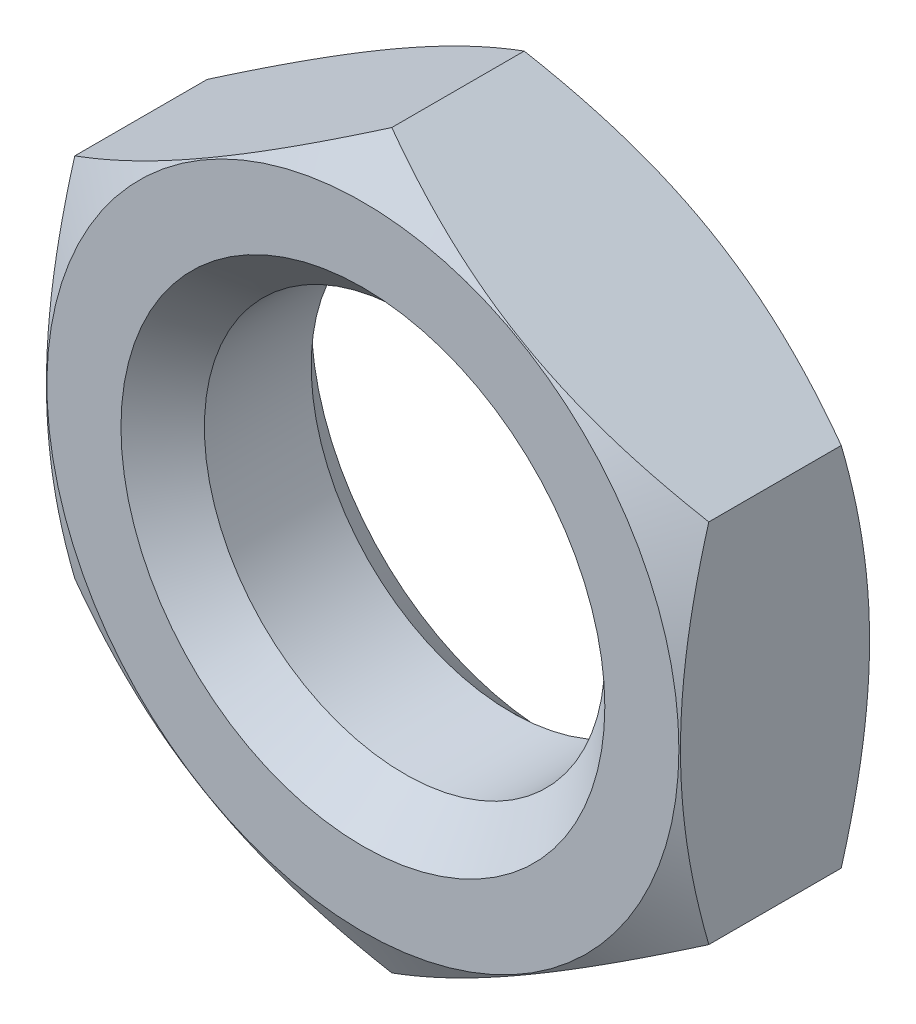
ISO-10303-21;
HEADER;
FILE_DESCRIPTION(('STEP AP214'),'2;1');
FILE_NAME('part.step','',(''),(''),'','','');
FILE_SCHEMA(('AUTOMOTIVE_DESIGN { 1 0 10303 214 1 1 1 1 }'));
ENDSEC;
DATA;
#1=APPLICATION_CONTEXT('core data for automotive mechanical design processes');
#2=APPLICATION_PROTOCOL_DEFINITION('international standard','automotive_design',2000,#1);
#3=PRODUCT_CONTEXT('',#1,'mechanical');
#4=PRODUCT('Part','Part','',(#3));
#5=PRODUCT_RELATED_PRODUCT_CATEGORY('part','',(#4));
#6=PRODUCT_DEFINITION_FORMATION('','',#4);
#7=PRODUCT_DEFINITION_CONTEXT('part definition',#1,'design');
#8=PRODUCT_DEFINITION('design','',#6,#7);
#9=PRODUCT_DEFINITION_SHAPE('','',#8);
#10=(LENGTH_UNIT() NAMED_UNIT(*) SI_UNIT(.MILLI.,.METRE.));
#11=(NAMED_UNIT(*) PLANE_ANGLE_UNIT() SI_UNIT($,.RADIAN.));
#12=(NAMED_UNIT(*) SI_UNIT($,.STERADIAN.) SOLID_ANGLE_UNIT());
#13=UNCERTAINTY_MEASURE_WITH_UNIT(LENGTH_MEASURE(1.E-05),#10,'distance_accuracy_value','');
#14=(GEOMETRIC_REPRESENTATION_CONTEXT(3) GLOBAL_UNCERTAINTY_ASSIGNED_CONTEXT((#13)) GLOBAL_UNIT_ASSIGNED_CONTEXT((#10,
#11,#12)) REPRESENTATION_CONTEXT('',''));
#15=CARTESIAN_POINT('',(0.,0.,0.));
#16=DIRECTION('',(0.,0.,1.));
#17=DIRECTION('',(1.,0.,0.));
#18=AXIS2_PLACEMENT_3D('',#15,#16,#17);
#19=CARTESIAN_POINT('',(9.5,5.48482755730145,2.85));
#20=DIRECTION('',(-0.5,-0.866025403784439,0.));
#21=DIRECTION('',(0.866025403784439,-0.5,0.));
#22=AXIS2_PLACEMENT_3D('',#19,#20,#21);
#23=PLANE('',#22);
#24=CARTESIAN_POINT('',(-0.000199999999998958,10.9697705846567,-1.98390792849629));
#25=CARTESIAN_POINT('',(0.208630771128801,10.8492020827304,-2.05350693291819));
#26=CARTESIAN_POINT('',(0.41824017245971,10.7281840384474,-2.11994706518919));
#27=CARTESIAN_POINT('',(0.839139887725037,10.4851774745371,-2.24563309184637));
#28=CARTESIAN_POINT('',(1.05043073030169,10.3631886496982,-2.30487662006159));
#29=CARTESIAN_POINT('',(1.68770779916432,9.99525656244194,-2.47066579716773));
#30=CARTESIAN_POINT('',(2.11620976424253,9.74786083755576,-2.56496593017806));
#31=CARTESIAN_POINT('',(2.75744333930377,9.37764446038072,-2.6755416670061));
#32=CARTESIAN_POINT('',(2.96825921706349,9.2559298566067,-2.70704054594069));
#33=CARTESIAN_POINT('',(3.39086703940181,9.01193711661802,-2.75986217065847));
#34=CARTESIAN_POINT('',(3.60265900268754,8.88965896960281,-2.78118472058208));
#35=CARTESIAN_POINT('',(4.02659621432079,8.64489870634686,-2.81310735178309));
#36=CARTESIAN_POINT('',(4.23874074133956,8.52241700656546,-2.82372017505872));
#37=CARTESIAN_POINT('',(4.66322575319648,8.27734047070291,-2.83399784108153));
#38=CARTESIAN_POINT('',(4.87556623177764,8.15474563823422,-2.83366302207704));
#39=CARTESIAN_POINT('',(5.27254199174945,7.92555157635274,-2.82280700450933));
#40=CARTESIAN_POINT('',(5.45720529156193,7.81893617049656,-2.81361010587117));
#41=CARTESIAN_POINT('',(5.82610000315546,7.60595470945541,-2.78711497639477));
#42=CARTESIAN_POINT('',(6.01033138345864,7.49958867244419,-2.76981617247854));
#43=CARTESIAN_POINT('',(6.562311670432,7.18090270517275,-2.70617589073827));
#44=CARTESIAN_POINT('',(6.92908353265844,6.96914687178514,-2.64809847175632));
#45=CARTESIAN_POINT('',(7.66651782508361,6.5433889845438,-2.50290435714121));
#46=CARTESIAN_POINT('',(8.03708614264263,6.32944126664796,-2.41517220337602));
#47=CARTESIAN_POINT('',(8.77269671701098,5.90473630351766,-2.21605663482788));
#48=CARTESIAN_POINT('',(9.13774839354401,5.69397361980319,-2.1047199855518));
#49=CARTESIAN_POINT('',(9.5002,5.48471208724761,-1.98390792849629));
#50=B_SPLINE_CURVE_WITH_KNOTS('',3,(#24,#25,#26,#27,#28,#29,#30,#31,#32,#33,#34,#35,#36,#37,#38,
#39,#40,#41,#42,#43,#44,#45,#46,#47,#48,#49),.UNSPECIFIED.,.F.,.F.,(4,2,2,2,2,2,2,2,2,2,2,2,4),
(0.,0.752880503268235,1.50600787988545,3.0154687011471,3.75167336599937,4.48789219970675,
5.22323407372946,5.95855322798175,6.5986808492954,7.23885375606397,8.52010929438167,
9.82978009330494,11.1368800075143),.UNSPECIFIED.);
#51=CARTESIAN_POINT('',(0.,10.9696551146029,-1.98397459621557));
#52=VERTEX_POINT('',#51);
#53=CARTESIAN_POINT('',(9.5,5.48482755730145,-1.98397459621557));
#54=VERTEX_POINT('',#53);
#55=EDGE_CURVE('E48',#52,#54,#50,.T.);
#56=ORIENTED_EDGE('',*,*,#55,.F.);
#57=DIRECTION('',(0.,0.,-1.));
#58=VECTOR('',#57,1.);
#59=CARTESIAN_POINT('',(0.,10.9696551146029,2.85));
#60=LINE('',#59,#58);
#61=CARTESIAN_POINT('',(0.,10.9696551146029,1.98397459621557));
#62=VERTEX_POINT('',#61);
#63=EDGE_CURVE('E97',#62,#52,#60,.T.);
#64=ORIENTED_EDGE('',*,*,#63,.F.);
#65=CARTESIAN_POINT('',(9.5002,5.48471208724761,1.98390792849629));
#66=CARTESIAN_POINT('',(9.2913692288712,5.6052805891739,2.05350693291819));
#67=CARTESIAN_POINT('',(9.08175982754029,5.72629863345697,2.11994706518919));
#68=CARTESIAN_POINT('',(8.66086011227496,5.96930519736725,2.24563309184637));
#69=CARTESIAN_POINT('',(8.44956926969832,6.09129402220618,2.30487662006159));
#70=CARTESIAN_POINT('',(7.81229220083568,6.4592261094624,2.47066579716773));
#71=CARTESIAN_POINT('',(7.38379023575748,6.70662183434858,2.56496593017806));
#72=CARTESIAN_POINT('',(6.74255666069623,7.07683821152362,2.6755416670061));
#73=CARTESIAN_POINT('',(6.53174078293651,7.19855281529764,2.70704054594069));
#74=CARTESIAN_POINT('',(6.10913296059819,7.44254555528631,2.75986217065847));
#75=CARTESIAN_POINT('',(5.89734099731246,7.56482370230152,2.78118472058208));
#76=CARTESIAN_POINT('',(5.47340378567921,7.80958396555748,2.81310735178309));
#77=CARTESIAN_POINT('',(5.26125925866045,7.93206566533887,2.82372017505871));
#78=CARTESIAN_POINT('',(4.83677424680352,8.17714220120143,2.83399784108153));
#79=CARTESIAN_POINT('',(4.62443376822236,8.29973703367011,2.83366302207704));
#80=CARTESIAN_POINT('',(4.22745800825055,8.5289310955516,2.82280700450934));
#81=CARTESIAN_POINT('',(4.04279470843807,8.63554650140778,2.81361010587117));
#82=CARTESIAN_POINT('',(3.67389999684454,8.84852796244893,2.78711497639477));
#83=CARTESIAN_POINT('',(3.48966861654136,8.95489399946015,2.76981617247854));
#84=CARTESIAN_POINT('',(2.937688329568,9.27357996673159,2.70617589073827));
#85=CARTESIAN_POINT('',(2.57091646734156,9.4853358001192,2.64809847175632));
#86=CARTESIAN_POINT('',(1.83348217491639,9.91109368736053,2.50290435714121));
#87=CARTESIAN_POINT('',(1.46291385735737,10.1250414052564,2.41517220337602));
#88=CARTESIAN_POINT('',(0.727303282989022,10.5497463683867,2.21605663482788));
#89=CARTESIAN_POINT('',(0.362251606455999,10.7605090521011,2.1047199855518));
#90=CARTESIAN_POINT('',(-0.000199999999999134,10.9697705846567,1.98390792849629));
#91=B_SPLINE_CURVE_WITH_KNOTS('',3,(#65,#66,#67,#68,#69,#70,#71,#72,#73,#74,#75,#76,#77,#78,#79,
#80,#81,#82,#83,#84,#85,#86,#87,#88,#89,#90),.UNSPECIFIED.,.F.,.F.,(4,2,2,2,2,2,2,2,2,2,2,2,4),
(0.,0.752880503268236,1.50600787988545,3.0154687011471,3.75167336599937,4.48789219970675,
5.22323407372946,5.95855322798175,6.5986808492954,7.23885375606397,8.52010929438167,
9.82978009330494,11.1368800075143),.UNSPECIFIED.);
#92=CARTESIAN_POINT('',(9.5,5.48482755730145,1.98397459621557));
#93=VERTEX_POINT('',#92);
#94=EDGE_CURVE('E199',#93,#62,#91,.T.);
#95=ORIENTED_EDGE('',*,*,#94,.F.);
#96=DIRECTION('',(0.,0.,-1.));
#97=VECTOR('',#96,1.);
#98=CARTESIAN_POINT('',(9.5,5.48482755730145,2.85));
#99=LINE('',#98,#97);
#100=EDGE_CURVE('E99',#93,#54,#99,.T.);
#101=ORIENTED_EDGE('',*,*,#100,.T.);
#102=EDGE_LOOP('',(#56,#64,#95,#101));
#103=FACE_BOUND('',#102,.T.);
#104=ADVANCED_FACE('F33',(#103),#23,.F.);
#105=CARTESIAN_POINT('',(0.,10.9696551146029,2.85));
#106=DIRECTION('',(0.5,-0.866025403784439,0.));
#107=DIRECTION('',(0.866025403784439,0.5,0.));
#108=AXIS2_PLACEMENT_3D('',#105,#106,#107);
#109=PLANE('',#108);
#110=CARTESIAN_POINT('',(-9.5002,5.48471208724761,-1.98390792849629));
#111=CARTESIAN_POINT('',(-9.2913692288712,5.6052805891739,-2.05350693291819));
#112=CARTESIAN_POINT('',(-9.08175982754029,5.72629863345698,-2.11994706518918));
#113=CARTESIAN_POINT('',(-8.66086011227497,5.96930519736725,-2.24563309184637));
#114=CARTESIAN_POINT('',(-8.44956926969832,6.09129402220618,-2.30487662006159));
#115=CARTESIAN_POINT('',(-7.81229220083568,6.4592261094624,-2.47066579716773));
#116=CARTESIAN_POINT('',(-7.38379023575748,6.70662183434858,-2.56496593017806));
#117=CARTESIAN_POINT('',(-6.74255666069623,7.07683821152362,-2.6755416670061));
#118=CARTESIAN_POINT('',(-6.53174078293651,7.19855281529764,-2.70704054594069));
#119=CARTESIAN_POINT('',(-6.10913296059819,7.44254555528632,-2.75986217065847));
#120=CARTESIAN_POINT('',(-5.89734099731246,7.56482370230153,-2.78118472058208));
#121=CARTESIAN_POINT('',(-5.47340378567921,7.80958396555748,-2.81310735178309));
#122=CARTESIAN_POINT('',(-5.26125925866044,7.93206566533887,-2.82372017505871));
#123=CARTESIAN_POINT('',(-4.83677424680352,8.17714220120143,-2.83399784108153));
#124=CARTESIAN_POINT('',(-4.62443376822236,8.29973703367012,-2.83366302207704));
#125=CARTESIAN_POINT('',(-4.22745800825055,8.5289310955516,-2.82280700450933));
#126=CARTESIAN_POINT('',(-4.04279470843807,8.63554650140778,-2.81361010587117));
#127=CARTESIAN_POINT('',(-3.67389999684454,8.84852796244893,-2.78711497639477));
#128=CARTESIAN_POINT('',(-3.48966861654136,8.95489399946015,-2.76981617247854));
#129=CARTESIAN_POINT('',(-2.937688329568,9.27357996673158,-2.70617589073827));
#130=CARTESIAN_POINT('',(-2.57091646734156,9.4853358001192,-2.64809847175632));
#131=CARTESIAN_POINT('',(-1.83348217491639,9.91109368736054,-2.50290435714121));
#132=CARTESIAN_POINT('',(-1.46291385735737,10.1250414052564,-2.41517220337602));
#133=CARTESIAN_POINT('',(-0.72730328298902,10.5497463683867,-2.21605663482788));
#134=CARTESIAN_POINT('',(-0.362251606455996,10.7605090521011,-2.1047199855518));
#135=CARTESIAN_POINT('',(0.000200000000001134,10.9697705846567,-1.98390792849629));
#136=B_SPLINE_CURVE_WITH_KNOTS('',3,(#110,#111,#112,#113,#114,#115,#116,#117,#118,#119,#120,
#121,#122,#123,#124,#125,#126,#127,#128,#129,#130,#131,#132,#133,#134,#135),.UNSPECIFIED.,.F.,
.F.,(4,2,2,2,2,2,2,2,2,2,2,2,4),(0.,0.752880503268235,1.50600787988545,3.0154687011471,
3.75167336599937,4.48789219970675,5.22323407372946,5.95855322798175,6.59868084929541,
7.23885375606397,8.52010929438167,9.82978009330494,11.1368800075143),.UNSPECIFIED.);
#137=CARTESIAN_POINT('',(-9.5,5.48482755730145,-1.98397459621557));
#138=VERTEX_POINT('',#137);
#139=EDGE_CURVE('E84',#138,#52,#136,.T.);
#140=ORIENTED_EDGE('',*,*,#139,.F.);
#141=DIRECTION('',(0.,0.,-1.));
#142=VECTOR('',#141,1.);
#143=CARTESIAN_POINT('',(-9.5,5.48482755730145,2.85));
#144=LINE('',#143,#142);
#145=CARTESIAN_POINT('',(-9.5,5.48482755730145,1.98397459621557));
#146=VERTEX_POINT('',#145);
#147=EDGE_CURVE('E106',#146,#138,#144,.T.);
#148=ORIENTED_EDGE('',*,*,#147,.F.);
#149=CARTESIAN_POINT('',(0.000200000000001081,10.9697705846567,1.98390792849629));
#150=CARTESIAN_POINT('',(-0.208630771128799,10.8492020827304,2.05350693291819));
#151=CARTESIAN_POINT('',(-0.418240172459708,10.7281840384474,2.11994706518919));
#152=CARTESIAN_POINT('',(-0.839139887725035,10.4851774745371,2.24563309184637));
#153=CARTESIAN_POINT('',(-1.05043073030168,10.3631886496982,2.30487662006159));
#154=CARTESIAN_POINT('',(-1.68770779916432,9.99525656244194,2.47066579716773));
#155=CARTESIAN_POINT('',(-2.11620976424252,9.74786083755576,2.56496593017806));
#156=CARTESIAN_POINT('',(-2.75744333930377,9.37764446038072,2.6755416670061));
#157=CARTESIAN_POINT('',(-2.96825921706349,9.2559298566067,2.70704054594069));
#158=CARTESIAN_POINT('',(-3.39086703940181,9.01193711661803,2.75986217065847));
#159=CARTESIAN_POINT('',(-3.60265900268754,8.88965896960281,2.78118472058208));
#160=CARTESIAN_POINT('',(-4.02659621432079,8.64489870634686,2.81310735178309));
#161=CARTESIAN_POINT('',(-4.23874074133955,8.52241700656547,2.82372017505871));
#162=CARTESIAN_POINT('',(-4.66322575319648,8.27734047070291,2.83399784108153));
#163=CARTESIAN_POINT('',(-4.87556623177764,8.15474563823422,2.83366302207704));
#164=CARTESIAN_POINT('',(-5.27254199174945,7.92555157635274,2.82280700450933));
#165=CARTESIAN_POINT('',(-5.45720529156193,7.81893617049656,2.81361010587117));
#166=CARTESIAN_POINT('',(-5.82610000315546,7.60595470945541,2.78711497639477));
#167=CARTESIAN_POINT('',(-6.01033138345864,7.49958867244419,2.76981617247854));
#168=CARTESIAN_POINT('',(-6.562311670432,7.18090270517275,2.70617589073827));
#169=CARTESIAN_POINT('',(-6.92908353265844,6.96914687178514,2.64809847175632));
#170=CARTESIAN_POINT('',(-7.66651782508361,6.5433889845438,2.50290435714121));
#171=CARTESIAN_POINT('',(-8.03708614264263,6.32944126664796,2.41517220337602));
#172=CARTESIAN_POINT('',(-8.77269671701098,5.90473630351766,2.21605663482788));
#173=CARTESIAN_POINT('',(-9.137748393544,5.69397361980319,2.1047199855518));
#174=CARTESIAN_POINT('',(-9.5002,5.48471208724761,1.98390792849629));
#175=B_SPLINE_CURVE_WITH_KNOTS('',3,(#149,#150,#151,#152,#153,#154,#155,#156,#157,#158,#159,
#160,#161,#162,#163,#164,#165,#166,#167,#168,#169,#170,#171,#172,#173,#174),.UNSPECIFIED.,.F.,
.F.,(4,2,2,2,2,2,2,2,2,2,2,2,4),(0.,0.752880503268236,1.50600787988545,3.0154687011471,
3.75167336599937,4.48789219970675,5.22323407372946,5.95855322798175,6.59868084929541,
7.23885375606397,8.52010929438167,9.82978009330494,11.1368800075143),.UNSPECIFIED.);
#176=EDGE_CURVE('E104',#62,#146,#175,.T.);
#177=ORIENTED_EDGE('',*,*,#176,.F.);
#178=ORIENTED_EDGE('',*,*,#63,.T.);
#179=EDGE_LOOP('',(#140,#148,#177,#178));
#180=FACE_BOUND('',#179,.T.);
#181=ADVANCED_FACE('F103',(#180),#109,.F.);
#182=CARTESIAN_POINT('',(-9.5,5.48482755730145,2.85));
#183=DIRECTION('',(1.,0.,0.));
#184=DIRECTION('',(0.,0.,-1.));
#185=AXIS2_PLACEMENT_3D('',#182,#183,#184);
#186=PLANE('',#185);
#187=CARTESIAN_POINT('',(-9.5,-14.5441411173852,1.71234877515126));
#188=CARTESIAN_POINT('',(-9.5,-14.3356064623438,1.6115512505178));
#189=CARTESIAN_POINT('',(-9.5,-14.1268196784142,1.51127559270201));
#190=CARTESIAN_POINT('',(-9.5,-13.7086885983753,1.31188780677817));
#191=CARTESIAN_POINT('',(-9.5,-13.499344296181,1.2127756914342));
#192=CARTESIAN_POINT('',(-9.5,-12.8703338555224,0.917335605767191));
#193=CARTESIAN_POINT('',(-9.5,-12.4497580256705,0.722936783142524));
#194=CARTESIAN_POINT('',(-9.5,-11.6032912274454,0.339426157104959));
#195=CARTESIAN_POINT('',(-9.5,-11.1773836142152,0.150350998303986));
#196=CARTESIAN_POINT('',(-9.5,-10.3220676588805,-0.21967779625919));
#197=CARTESIAN_POINT('',(-9.5,-9.89265950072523,-0.400631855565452));
#198=CARTESIAN_POINT('',(-9.5,-9.02433880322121,-0.754397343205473));
#199=CARTESIAN_POINT('',(-9.5,-8.58537427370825,-0.927081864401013));
#200=CARTESIAN_POINT('',(-9.5,-7.7022679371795,-1.25892058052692));
#201=CARTESIAN_POINT('',(-9.5,-7.25812556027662,-1.41807326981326));
#202=CARTESIAN_POINT('',(-9.5,-6.36486440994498,-1.71856922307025));
#203=CARTESIAN_POINT('',(-9.5,-5.91575852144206,-1.85995037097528));
#204=CARTESIAN_POINT('',(-9.5,-5.01117837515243,-2.12031248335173));
#205=CARTESIAN_POINT('',(-9.5,-4.55570618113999,-2.23930053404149));
#206=CARTESIAN_POINT('',(-9.5,-3.63800520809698,-2.44908988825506));
#207=CARTESIAN_POINT('',(-9.5,-3.17577463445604,-2.53988355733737));
#208=CARTESIAN_POINT('',(-9.5,-2.47836338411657,-2.65038075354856));
#209=CARTESIAN_POINT('',(-9.5,-2.24518677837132,-2.68293333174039));
#210=CARTESIAN_POINT('',(-9.5,-1.77774118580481,-2.73883350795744));
#211=CARTESIAN_POINT('',(-9.5,-1.54347230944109,-2.76218201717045));
#212=CARTESIAN_POINT('',(-9.5,-1.07564354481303,-2.79904583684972));
#213=CARTESIAN_POINT('',(-9.5,-0.842088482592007,-2.81262214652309));
#214=CARTESIAN_POINT('',(-9.5,-0.374613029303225,-2.82986982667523));
#215=CARTESIAN_POINT('',(-9.5,-0.140692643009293,-2.83354132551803));
#216=CARTESIAN_POINT('',(-9.5,0.327026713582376,-2.83089191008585));
#217=CARTESIAN_POINT('',(-9.5,0.560825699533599,-2.8245737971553));
#218=CARTESIAN_POINT('',(-9.5,1.02795364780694,-2.80210220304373));
#219=CARTESIAN_POINT('',(-9.5,1.26128258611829,-2.78594823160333));
#220=CARTESIAN_POINT('',(-9.5,1.82687816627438,-2.735206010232));
#221=CARTESIAN_POINT('',(-9.5,2.15870953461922,-2.69568528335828));
#222=CARTESIAN_POINT('',(-9.5,2.81982783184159,-2.59894476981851));
#223=CARTESIAN_POINT('',(-9.5,3.14911404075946,-2.54172015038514));
#224=CARTESIAN_POINT('',(-9.5,3.80487091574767,-2.41160145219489));
#225=CARTESIAN_POINT('',(-9.5,4.1313386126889,-2.33869255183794));
#226=CARTESIAN_POINT('',(-9.5,4.78091434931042,-2.17942968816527));
#227=CARTESIAN_POINT('',(-9.5,5.10402270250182,-2.0930769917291));
#228=CARTESIAN_POINT('',(-9.5,5.75483447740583,-1.90673599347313));
#229=CARTESIAN_POINT('',(-9.5,6.08245652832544,-1.80646544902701));
#230=CARTESIAN_POINT('',(-9.5,6.73423760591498,-1.59602223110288));
#231=CARTESIAN_POINT('',(-9.5,7.05839885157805,-1.48585638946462));
#232=CARTESIAN_POINT('',(-9.5,7.70195753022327,-1.25789772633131));
#233=CARTESIAN_POINT('',(-9.5,8.02137150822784,-1.14015133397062));
#234=CARTESIAN_POINT('',(-9.5,8.65772169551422,-0.897750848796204));
#235=CARTESIAN_POINT('',(-9.5,8.97465684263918,-0.773093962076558));
#236=CARTESIAN_POINT('',(-9.5,9.29044082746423,-0.645665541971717));
#237=B_SPLINE_CURVE_WITH_KNOTS('',3,(#187,#188,#189,#190,#191,#192,#193,#194,#195,#196,#197,
#198,#199,#200,#201,#202,#203,#204,#205,#206,#207,#208,#209,#210,#211,#212,#213,#214,#215,#216,
#217,#218,#219,#220,#221,#222,#223,#224,#225,#226,#227,#228,#229,#230,#231,#232,#233,#234,#235,
#236),.UNSPECIFIED.,.F.,.F.,(4,2,2,2,2,2,2,2,2,2,2,2,2,2,2,2,2,2,2,2,2,2,2,2,4),(0.,
0.694852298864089,1.38971221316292,2.77965820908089,4.17756254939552,5.57539389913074,
6.99034929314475,8.40546191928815,9.81750483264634,11.2291001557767,12.6410773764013,
13.3472378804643,14.0533284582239,14.754972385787,15.4566072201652,16.1580453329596,
16.859518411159,17.8614895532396,18.8637344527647,19.866930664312,20.8700323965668,
21.897710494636,22.9246844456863,23.9458768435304,24.9674851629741),.UNSPECIFIED.);
#238=CARTESIAN_POINT('',(-9.5,-5.48482755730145,-1.98397459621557));
#239=VERTEX_POINT('',#238);
#240=EDGE_CURVE('E87',#239,#138,#237,.T.);
#241=ORIENTED_EDGE('',*,*,#240,.F.);
#242=DIRECTION('',(0.,0.,-1.));
#243=VECTOR('',#242,1.);
#244=CARTESIAN_POINT('',(-9.5,-5.48482755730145,2.85));
#245=LINE('',#244,#243);
#246=CARTESIAN_POINT('',(-9.5,-5.48482755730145,1.98397459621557));
#247=VERTEX_POINT('',#246);
#248=EDGE_CURVE('E111',#247,#239,#245,.T.);
#249=ORIENTED_EDGE('',*,*,#248,.F.);
#250=CARTESIAN_POINT('',(-9.5,-14.5441411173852,-1.71234877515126));
#251=CARTESIAN_POINT('',(-9.5,-14.3356064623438,-1.6115512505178));
#252=CARTESIAN_POINT('',(-9.5,-14.1268196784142,-1.51127559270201));
#253=CARTESIAN_POINT('',(-9.5,-13.7086885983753,-1.31188780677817));
#254=CARTESIAN_POINT('',(-9.5,-13.499344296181,-1.2127756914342));
#255=CARTESIAN_POINT('',(-9.5,-12.8703338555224,-0.917335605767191));
#256=CARTESIAN_POINT('',(-9.5,-12.4497580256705,-0.722936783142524));
#257=CARTESIAN_POINT('',(-9.5,-11.6032912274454,-0.339426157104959));
#258=CARTESIAN_POINT('',(-9.5,-11.1773836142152,-0.150350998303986));
#259=CARTESIAN_POINT('',(-9.5,-10.3220676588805,0.21967779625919));
#260=CARTESIAN_POINT('',(-9.5,-9.89265950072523,0.400631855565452));
#261=CARTESIAN_POINT('',(-9.5,-9.02433880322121,0.754397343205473));
#262=CARTESIAN_POINT('',(-9.5,-8.58537427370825,0.927081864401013));
#263=CARTESIAN_POINT('',(-9.5,-7.7022679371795,1.25892058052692));
#264=CARTESIAN_POINT('',(-9.5,-7.25812556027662,1.41807326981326));
#265=CARTESIAN_POINT('',(-9.5,-6.36486440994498,1.71856922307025));
#266=CARTESIAN_POINT('',(-9.5,-5.91575852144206,1.85995037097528));
#267=CARTESIAN_POINT('',(-9.5,-5.01117837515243,2.12031248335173));
#268=CARTESIAN_POINT('',(-9.5,-4.55570618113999,2.23930053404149));
#269=CARTESIAN_POINT('',(-9.5,-3.63800520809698,2.44908988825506));
#270=CARTESIAN_POINT('',(-9.5,-3.17577463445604,2.53988355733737));
#271=CARTESIAN_POINT('',(-9.5,-2.47836338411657,2.65038075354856));
#272=CARTESIAN_POINT('',(-9.5,-2.24518677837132,2.68293333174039));
#273=CARTESIAN_POINT('',(-9.5,-1.77774118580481,2.73883350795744));
#274=CARTESIAN_POINT('',(-9.5,-1.54347230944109,2.76218201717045));
#275=CARTESIAN_POINT('',(-9.5,-1.07564354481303,2.79904583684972));
#276=CARTESIAN_POINT('',(-9.5,-0.842088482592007,2.81262214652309));
#277=CARTESIAN_POINT('',(-9.5,-0.374613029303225,2.82986982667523));
#278=CARTESIAN_POINT('',(-9.5,-0.140692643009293,2.83354132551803));
#279=CARTESIAN_POINT('',(-9.5,0.327026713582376,2.83089191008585));
#280=CARTESIAN_POINT('',(-9.5,0.560825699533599,2.8245737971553));
#281=CARTESIAN_POINT('',(-9.5,1.02795364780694,2.80210220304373));
#282=CARTESIAN_POINT('',(-9.5,1.26128258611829,2.78594823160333));
#283=CARTESIAN_POINT('',(-9.5,1.82687816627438,2.735206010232));
#284=CARTESIAN_POINT('',(-9.5,2.15870953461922,2.69568528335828));
#285=CARTESIAN_POINT('',(-9.5,2.81982783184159,2.59894476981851));
#286=CARTESIAN_POINT('',(-9.5,3.14911404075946,2.54172015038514));
#287=CARTESIAN_POINT('',(-9.5,3.80487091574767,2.41160145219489));
#288=CARTESIAN_POINT('',(-9.5,4.1313386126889,2.33869255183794));
#289=CARTESIAN_POINT('',(-9.5,4.78091434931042,2.17942968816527));
#290=CARTESIAN_POINT('',(-9.5,5.10402270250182,2.0930769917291));
#291=CARTESIAN_POINT('',(-9.5,5.75483447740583,1.90673599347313));
#292=CARTESIAN_POINT('',(-9.5,6.08245652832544,1.80646544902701));
#293=CARTESIAN_POINT('',(-9.5,6.73423760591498,1.59602223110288));
#294=CARTESIAN_POINT('',(-9.5,7.05839885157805,1.48585638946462));
#295=CARTESIAN_POINT('',(-9.5,7.70195753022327,1.25789772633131));
#296=CARTESIAN_POINT('',(-9.5,8.02137150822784,1.14015133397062));
#297=CARTESIAN_POINT('',(-9.5,8.65772169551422,0.897750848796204));
#298=CARTESIAN_POINT('',(-9.5,8.97465684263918,0.773093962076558));
#299=CARTESIAN_POINT('',(-9.5,9.29044082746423,0.645665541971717));
#300=B_SPLINE_CURVE_WITH_KNOTS('',3,(#250,#251,#252,#253,#254,#255,#256,#257,#258,#259,#260,
#261,#262,#263,#264,#265,#266,#267,#268,#269,#270,#271,#272,#273,#274,#275,#276,#277,#278,#279,
#280,#281,#282,#283,#284,#285,#286,#287,#288,#289,#290,#291,#292,#293,#294,#295,#296,#297,#298,
#299),.UNSPECIFIED.,.F.,.F.,(4,2,2,2,2,2,2,2,2,2,2,2,2,2,2,2,2,2,2,2,2,2,2,2,4),(0.,
0.694852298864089,1.38971221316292,2.77965820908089,4.17756254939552,5.57539389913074,
6.99034929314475,8.40546191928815,9.81750483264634,11.2291001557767,12.6410773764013,
13.3472378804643,14.0533284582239,14.754972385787,15.4566072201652,16.1580453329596,
16.859518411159,17.8614895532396,18.8637344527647,19.866930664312,20.8700323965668,
21.897710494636,22.9246844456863,23.9458768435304,24.9674851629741),.UNSPECIFIED.);
#301=EDGE_CURVE('E189',#146,#247,#300,.F.);
#302=ORIENTED_EDGE('',*,*,#301,.F.);
#303=ORIENTED_EDGE('',*,*,#147,.T.);
#304=EDGE_LOOP('',(#241,#249,#302,#303));
#305=FACE_BOUND('',#304,.T.);
#306=ADVANCED_FACE('F207',(#305),#186,.F.);
#307=CARTESIAN_POINT('',(-9.5,-5.48482755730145,2.85));
#308=DIRECTION('',(0.5,0.866025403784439,0.));
#309=DIRECTION('',(-0.866025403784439,0.5,0.));
#310=AXIS2_PLACEMENT_3D('',#307,#308,#309);
#311=PLANE('',#310);
#312=CARTESIAN_POINT('',(0.000199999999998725,-10.9697705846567,-1.98390792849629));
#313=CARTESIAN_POINT('',(-0.208630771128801,-10.8492020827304,-2.05350693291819));
#314=CARTESIAN_POINT('',(-0.41824017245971,-10.7281840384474,-2.11994706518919));
#315=CARTESIAN_POINT('',(-0.839139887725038,-10.4851774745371,-2.24563309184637));
#316=CARTESIAN_POINT('',(-1.05043073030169,-10.3631886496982,-2.30487662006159));
#317=CARTESIAN_POINT('',(-1.68770779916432,-9.99525656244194,-2.47066579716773));
#318=CARTESIAN_POINT('',(-2.11620976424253,-9.74786083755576,-2.56496593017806));
#319=CARTESIAN_POINT('',(-2.75744333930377,-9.37764446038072,-2.6755416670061));
#320=CARTESIAN_POINT('',(-2.96825921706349,-9.2559298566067,-2.70704054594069));
#321=CARTESIAN_POINT('',(-3.39086703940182,-9.01193711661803,-2.75986217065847));
#322=CARTESIAN_POINT('',(-3.60265900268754,-8.88965896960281,-2.78118472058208));
#323=CARTESIAN_POINT('',(-4.02659621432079,-8.64489870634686,-2.81310735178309));
#324=CARTESIAN_POINT('',(-4.23874074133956,-8.52241700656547,-2.82372017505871));
#325=CARTESIAN_POINT('',(-4.66322575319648,-8.27734047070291,-2.83399784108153));
#326=CARTESIAN_POINT('',(-4.87556623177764,-8.15474563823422,-2.83366302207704));
#327=CARTESIAN_POINT('',(-5.27254199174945,-7.92555157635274,-2.82280700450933));
#328=CARTESIAN_POINT('',(-5.45720529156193,-7.81893617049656,-2.81361010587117));
#329=CARTESIAN_POINT('',(-5.82610000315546,-7.60595470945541,-2.78711497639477));
#330=CARTESIAN_POINT('',(-6.01033138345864,-7.49958867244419,-2.76981617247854));
#331=CARTESIAN_POINT('',(-6.562311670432,-7.18090270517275,-2.70617589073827));
#332=CARTESIAN_POINT('',(-6.92908353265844,-6.96914687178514,-2.64809847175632));
#333=CARTESIAN_POINT('',(-7.66651782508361,-6.5433889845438,-2.50290435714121));
#334=CARTESIAN_POINT('',(-8.03708614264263,-6.32944126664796,-2.41517220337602));
#335=CARTESIAN_POINT('',(-8.77269671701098,-5.90473630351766,-2.21605663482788));
#336=CARTESIAN_POINT('',(-9.13774839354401,-5.69397361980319,-2.1047199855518));
#337=CARTESIAN_POINT('',(-9.5002,-5.48471208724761,-1.98390792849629));
#338=B_SPLINE_CURVE_WITH_KNOTS('',3,(#312,#313,#314,#315,#316,#317,#318,#319,#320,#321,#322,
#323,#324,#325,#326,#327,#328,#329,#330,#331,#332,#333,#334,#335,#336,#337),.UNSPECIFIED.,.F.,
.F.,(4,2,2,2,2,2,2,2,2,2,2,2,4),(0.,0.752880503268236,1.50600787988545,3.0154687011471,
3.75167336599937,4.48789219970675,5.22323407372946,5.95855322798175,6.59868084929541,
7.23885375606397,8.52010929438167,9.82978009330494,11.1368800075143),.UNSPECIFIED.);
#339=CARTESIAN_POINT('',(0.,-10.9696551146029,-1.98397459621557));
#340=VERTEX_POINT('',#339);
#341=EDGE_CURVE('E221',#340,#239,#338,.T.);
#342=ORIENTED_EDGE('',*,*,#341,.F.);
#343=DIRECTION('',(0.,0.,-1.));
#344=VECTOR('',#343,1.);
#345=CARTESIAN_POINT('',(0.,-10.9696551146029,2.85));
#346=LINE('',#345,#344);
#347=CARTESIAN_POINT('',(0.,-10.9696551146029,1.98397459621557));
#348=VERTEX_POINT('',#347);
#349=EDGE_CURVE('E321',#348,#340,#346,.T.);
#350=ORIENTED_EDGE('',*,*,#349,.F.);
#351=CARTESIAN_POINT('',(-9.5002,-5.48471208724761,1.98390792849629));
#352=CARTESIAN_POINT('',(-9.2913692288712,-5.6052805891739,2.05350693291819));
#353=CARTESIAN_POINT('',(-9.08175982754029,-5.72629863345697,2.11994706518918));
#354=CARTESIAN_POINT('',(-8.66086011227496,-5.96930519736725,2.24563309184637));
#355=CARTESIAN_POINT('',(-8.44956926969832,-6.09129402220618,2.30487662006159));
#356=CARTESIAN_POINT('',(-7.81229220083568,-6.4592261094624,2.47066579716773));
#357=CARTESIAN_POINT('',(-7.38379023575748,-6.70662183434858,2.56496593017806));
#358=CARTESIAN_POINT('',(-6.74255666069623,-7.07683821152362,2.6755416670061));
#359=CARTESIAN_POINT('',(-6.53174078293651,-7.19855281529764,2.70704054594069));
#360=CARTESIAN_POINT('',(-6.10913296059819,-7.44254555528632,2.75986217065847));
#361=CARTESIAN_POINT('',(-5.89734099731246,-7.56482370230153,2.78118472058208));
#362=CARTESIAN_POINT('',(-5.47340378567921,-7.80958396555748,2.81310735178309));
#363=CARTESIAN_POINT('',(-5.26125925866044,-7.93206566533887,2.82372017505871));
#364=CARTESIAN_POINT('',(-4.83677424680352,-8.17714220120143,2.83399784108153));
#365=CARTESIAN_POINT('',(-4.62443376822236,-8.29973703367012,2.83366302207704));
#366=CARTESIAN_POINT('',(-4.22745800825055,-8.5289310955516,2.82280700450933));
#367=CARTESIAN_POINT('',(-4.04279470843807,-8.63554650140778,2.81361010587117));
#368=CARTESIAN_POINT('',(-3.67389999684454,-8.84852796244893,2.78711497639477));
#369=CARTESIAN_POINT('',(-3.48966861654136,-8.95489399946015,2.76981617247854));
#370=CARTESIAN_POINT('',(-2.937688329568,-9.27357996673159,2.70617589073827));
#371=CARTESIAN_POINT('',(-2.57091646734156,-9.4853358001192,2.64809847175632));
#372=CARTESIAN_POINT('',(-1.83348217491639,-9.91109368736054,2.50290435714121));
#373=CARTESIAN_POINT('',(-1.46291385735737,-10.1250414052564,2.41517220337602));
#374=CARTESIAN_POINT('',(-0.727303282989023,-10.5497463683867,2.21605663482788));
#375=CARTESIAN_POINT('',(-0.362251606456,-10.7605090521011,2.1047199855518));
#376=CARTESIAN_POINT('',(0.000199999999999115,-10.9697705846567,1.98390792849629));
#377=B_SPLINE_CURVE_WITH_KNOTS('',3,(#351,#352,#353,#354,#355,#356,#357,#358,#359,#360,#361,
#362,#363,#364,#365,#366,#367,#368,#369,#370,#371,#372,#373,#374,#375,#376),.UNSPECIFIED.,.F.,
.F.,(4,2,2,2,2,2,2,2,2,2,2,2,4),(0.,0.752880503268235,1.50600787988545,3.0154687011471,
3.75167336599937,4.48789219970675,5.22323407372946,5.95855322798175,6.59868084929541,
7.23885375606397,8.52010929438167,9.82978009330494,11.1368800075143),.UNSPECIFIED.);
#378=EDGE_CURVE('E184',#247,#348,#377,.T.);
#379=ORIENTED_EDGE('',*,*,#378,.F.);
#380=ORIENTED_EDGE('',*,*,#248,.T.);
#381=EDGE_LOOP('',(#342,#350,#379,#380));
#382=FACE_BOUND('',#381,.T.);
#383=ADVANCED_FACE('F225',(#382),#311,.F.);
#384=CARTESIAN_POINT('',(0.,-10.9696551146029,2.85));
#385=DIRECTION('',(-0.5,0.866025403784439,0.));
#386=DIRECTION('',(-0.866025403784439,-0.5,0.));
#387=AXIS2_PLACEMENT_3D('',#384,#385,#386);
#388=PLANE('',#387);
#389=CARTESIAN_POINT('',(9.5002,-5.48471208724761,-1.98390792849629));
#390=CARTESIAN_POINT('',(9.2913692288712,-5.6052805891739,-2.05350693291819));
#391=CARTESIAN_POINT('',(9.08175982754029,-5.72629863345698,-2.11994706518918));
#392=CARTESIAN_POINT('',(8.66086011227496,-5.96930519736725,-2.24563309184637));
#393=CARTESIAN_POINT('',(8.44956926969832,-6.09129402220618,-2.30487662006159));
#394=CARTESIAN_POINT('',(7.81229220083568,-6.4592261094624,-2.47066579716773));
#395=CARTESIAN_POINT('',(7.38379023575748,-6.70662183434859,-2.56496593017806));
#396=CARTESIAN_POINT('',(6.74255666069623,-7.07683821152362,-2.6755416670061));
#397=CARTESIAN_POINT('',(6.53174078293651,-7.19855281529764,-2.70704054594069));
#398=CARTESIAN_POINT('',(6.10913296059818,-7.44254555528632,-2.75986217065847));
#399=CARTESIAN_POINT('',(5.89734099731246,-7.56482370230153,-2.78118472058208));
#400=CARTESIAN_POINT('',(5.47340378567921,-7.80958396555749,-2.81310735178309));
#401=CARTESIAN_POINT('',(5.26125925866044,-7.93206566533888,-2.82372017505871));
#402=CARTESIAN_POINT('',(4.83677424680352,-8.17714220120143,-2.83399784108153));
#403=CARTESIAN_POINT('',(4.62443376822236,-8.29973703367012,-2.83366302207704));
#404=CARTESIAN_POINT('',(4.22745800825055,-8.5289310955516,-2.82280700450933));
#405=CARTESIAN_POINT('',(4.04279470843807,-8.63554650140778,-2.81361010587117));
#406=CARTESIAN_POINT('',(3.67389999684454,-8.84852796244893,-2.78711497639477));
#407=CARTESIAN_POINT('',(3.48966861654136,-8.95489399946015,-2.76981617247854));
#408=CARTESIAN_POINT('',(2.937688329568,-9.27357996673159,-2.70617589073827));
#409=CARTESIAN_POINT('',(2.57091646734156,-9.4853358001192,-2.64809847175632));
#410=CARTESIAN_POINT('',(1.83348217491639,-9.91109368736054,-2.5029043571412));
#411=CARTESIAN_POINT('',(1.46291385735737,-10.1250414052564,-2.41517220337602));
#412=CARTESIAN_POINT('',(0.727303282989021,-10.5497463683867,-2.21605663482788));
#413=CARTESIAN_POINT('',(0.362251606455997,-10.7605090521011,-2.1047199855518));
#414=CARTESIAN_POINT('',(-0.000200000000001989,-10.9697705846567,-1.98390792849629));
#415=B_SPLINE_CURVE_WITH_KNOTS('',3,(#389,#390,#391,#392,#393,#394,#395,#396,#397,#398,#399,
#400,#401,#402,#403,#404,#405,#406,#407,#408,#409,#410,#411,#412,#413,#414),.UNSPECIFIED.,.F.,
.F.,(4,2,2,2,2,2,2,2,2,2,2,2,4),(0.,0.752880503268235,1.50600787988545,3.0154687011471,
3.75167336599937,4.48789219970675,5.22323407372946,5.95855322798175,6.59868084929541,
7.23885375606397,8.52010929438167,9.82978009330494,11.1368800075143),.UNSPECIFIED.);
#416=CARTESIAN_POINT('',(9.5,-5.48482755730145,-1.98397459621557));
#417=VERTEX_POINT('',#416);
#418=EDGE_CURVE('E137',#417,#340,#415,.T.);
#419=ORIENTED_EDGE('',*,*,#418,.F.);
#420=DIRECTION('',(0.,0.,-1.));
#421=VECTOR('',#420,1.);
#422=CARTESIAN_POINT('',(9.5,-5.48482755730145,2.85));
#423=LINE('',#422,#421);
#424=CARTESIAN_POINT('',(9.5,-5.48482755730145,1.98397459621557));
#425=VERTEX_POINT('',#424);
#426=EDGE_CURVE('E319',#425,#417,#423,.T.);
#427=ORIENTED_EDGE('',*,*,#426,.F.);
#428=CARTESIAN_POINT('',(-0.000200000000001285,-10.9697705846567,1.98390792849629));
#429=CARTESIAN_POINT('',(0.208630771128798,-10.8492020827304,2.05350693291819));
#430=CARTESIAN_POINT('',(0.418240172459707,-10.7281840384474,2.11994706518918));
#431=CARTESIAN_POINT('',(0.839139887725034,-10.4851774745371,2.24563309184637));
#432=CARTESIAN_POINT('',(1.05043073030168,-10.3631886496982,2.30487662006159));
#433=CARTESIAN_POINT('',(1.68770779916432,-9.99525656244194,2.47066579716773));
#434=CARTESIAN_POINT('',(2.11620976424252,-9.74786083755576,2.56496593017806));
#435=CARTESIAN_POINT('',(2.75744333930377,-9.37764446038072,2.6755416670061));
#436=CARTESIAN_POINT('',(2.96825921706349,-9.2559298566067,2.70704054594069));
#437=CARTESIAN_POINT('',(3.39086703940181,-9.01193711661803,2.75986217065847));
#438=CARTESIAN_POINT('',(3.60265900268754,-8.88965896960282,2.78118472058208));
#439=CARTESIAN_POINT('',(4.02659621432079,-8.64489870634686,2.81310735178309));
#440=CARTESIAN_POINT('',(4.23874074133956,-8.52241700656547,2.82372017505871));
#441=CARTESIAN_POINT('',(4.66322575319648,-8.27734047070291,2.83399784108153));
#442=CARTESIAN_POINT('',(4.87556623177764,-8.15474563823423,2.83366302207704));
#443=CARTESIAN_POINT('',(5.27254199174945,-7.92555157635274,2.82280700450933));
#444=CARTESIAN_POINT('',(5.45720529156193,-7.81893617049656,2.81361010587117));
#445=CARTESIAN_POINT('',(5.82610000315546,-7.60595470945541,2.78711497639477));
#446=CARTESIAN_POINT('',(6.01033138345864,-7.49958867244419,2.76981617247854));
#447=CARTESIAN_POINT('',(6.562311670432,-7.18090270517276,2.70617589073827));
#448=CARTESIAN_POINT('',(6.92908353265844,-6.96914687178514,2.64809847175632));
#449=CARTESIAN_POINT('',(7.66651782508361,-6.54338898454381,2.5029043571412));
#450=CARTESIAN_POINT('',(8.03708614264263,-6.32944126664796,2.41517220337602));
#451=CARTESIAN_POINT('',(8.77269671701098,-5.90473630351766,2.21605663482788));
#452=CARTESIAN_POINT('',(9.137748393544,-5.6939736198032,2.1047199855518));
#453=CARTESIAN_POINT('',(9.5002,-5.48471208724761,1.98390792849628));
#454=B_SPLINE_CURVE_WITH_KNOTS('',3,(#428,#429,#430,#431,#432,#433,#434,#435,#436,#437,#438,
#439,#440,#441,#442,#443,#444,#445,#446,#447,#448,#449,#450,#451,#452,#453),.UNSPECIFIED.,.F.,
.F.,(4,2,2,2,2,2,2,2,2,2,2,2,4),(0.,0.752880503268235,1.50600787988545,3.0154687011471,
3.75167336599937,4.48789219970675,5.22323407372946,5.95855322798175,6.59868084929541,
7.23885375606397,8.52010929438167,9.82978009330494,11.1368800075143),.UNSPECIFIED.);
#455=EDGE_CURVE('E56',#348,#425,#454,.T.);
#456=ORIENTED_EDGE('',*,*,#455,.F.);
#457=ORIENTED_EDGE('',*,*,#349,.T.);
#458=EDGE_LOOP('',(#419,#427,#456,#457));
#459=FACE_BOUND('',#458,.T.);
#460=ADVANCED_FACE('F157',(#459),#388,.F.);
#461=CARTESIAN_POINT('',(9.5,-5.48482755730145,2.85));
#462=DIRECTION('',(-1.,0.,0.));
#463=DIRECTION('',(0.,0.,1.));
#464=AXIS2_PLACEMENT_3D('',#461,#462,#463);
#465=PLANE('',#464);
#466=CARTESIAN_POINT('',(9.5,-14.5441411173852,1.71234877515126));
#467=CARTESIAN_POINT('',(9.5,-14.3356064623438,1.6115512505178));
#468=CARTESIAN_POINT('',(9.5,-14.1268196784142,1.51127559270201));
#469=CARTESIAN_POINT('',(9.5,-13.7086885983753,1.31188780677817));
#470=CARTESIAN_POINT('',(9.5,-13.499344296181,1.2127756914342));
#471=CARTESIAN_POINT('',(9.5,-12.8703338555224,0.917335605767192));
#472=CARTESIAN_POINT('',(9.5,-12.4497580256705,0.722936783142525));
#473=CARTESIAN_POINT('',(9.5,-11.6032912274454,0.33942615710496));
#474=CARTESIAN_POINT('',(9.5,-11.1773836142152,0.150350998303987));
#475=CARTESIAN_POINT('',(9.5,-10.3220676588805,-0.219677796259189));
#476=CARTESIAN_POINT('',(9.5,-9.89265950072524,-0.400631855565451));
#477=CARTESIAN_POINT('',(9.5,-9.02433880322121,-0.754397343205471));
#478=CARTESIAN_POINT('',(9.5,-8.58537427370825,-0.927081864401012));
#479=CARTESIAN_POINT('',(9.5,-7.70226793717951,-1.25892058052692));
#480=CARTESIAN_POINT('',(9.5,-7.25812556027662,-1.41807326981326));
#481=CARTESIAN_POINT('',(9.5,-6.36486440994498,-1.71856922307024));
#482=CARTESIAN_POINT('',(9.5,-5.91575852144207,-1.85995037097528));
#483=CARTESIAN_POINT('',(9.5,-5.01117837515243,-2.12031248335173));
#484=CARTESIAN_POINT('',(9.5,-4.55570618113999,-2.23930053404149));
#485=CARTESIAN_POINT('',(9.5,-3.63800520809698,-2.44908988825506));
#486=CARTESIAN_POINT('',(9.5,-3.17577463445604,-2.53988355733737));
#487=CARTESIAN_POINT('',(9.5,-2.47836338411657,-2.65038075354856));
#488=CARTESIAN_POINT('',(9.5,-2.24518677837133,-2.68293333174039));
#489=CARTESIAN_POINT('',(9.5,-1.77774118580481,-2.73883350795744));
#490=CARTESIAN_POINT('',(9.5,-1.54347230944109,-2.76218201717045));
#491=CARTESIAN_POINT('',(9.5,-1.07564354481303,-2.79904583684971));
#492=CARTESIAN_POINT('',(9.5,-0.842088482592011,-2.81262214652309));
#493=CARTESIAN_POINT('',(9.5,-0.374613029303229,-2.82986982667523));
#494=CARTESIAN_POINT('',(9.5,-0.140692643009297,-2.83354132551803));
#495=CARTESIAN_POINT('',(9.5,0.327026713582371,-2.83089191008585));
#496=CARTESIAN_POINT('',(9.5,0.560825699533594,-2.8245737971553));
#497=CARTESIAN_POINT('',(9.5,1.02795364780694,-2.80210220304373));
#498=CARTESIAN_POINT('',(9.5,1.26128258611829,-2.78594823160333));
#499=CARTESIAN_POINT('',(9.5,1.82687816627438,-2.735206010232));
#500=CARTESIAN_POINT('',(9.5,2.15870953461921,-2.69568528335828));
#501=CARTESIAN_POINT('',(9.5,2.81982783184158,-2.59894476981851));
#502=CARTESIAN_POINT('',(9.5,3.14911404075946,-2.54172015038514));
#503=CARTESIAN_POINT('',(9.5,3.80487091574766,-2.41160145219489));
#504=CARTESIAN_POINT('',(9.5,4.13133861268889,-2.33869255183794));
#505=CARTESIAN_POINT('',(9.5,4.78091434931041,-2.17942968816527));
#506=CARTESIAN_POINT('',(9.5,5.10402270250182,-2.0930769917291));
#507=CARTESIAN_POINT('',(9.5,5.75483447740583,-1.90673599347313));
#508=CARTESIAN_POINT('',(9.5,6.08245652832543,-1.80646544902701));
#509=CARTESIAN_POINT('',(9.5,6.73423760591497,-1.59602223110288));
#510=CARTESIAN_POINT('',(9.5,7.05839885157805,-1.48585638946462));
#511=CARTESIAN_POINT('',(9.5,7.70195753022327,-1.25789772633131));
#512=CARTESIAN_POINT('',(9.5,8.02137150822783,-1.14015133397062));
#513=CARTESIAN_POINT('',(9.5,8.65772169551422,-0.897750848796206));
#514=CARTESIAN_POINT('',(9.5,8.97465684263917,-0.773093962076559));
#515=CARTESIAN_POINT('',(9.5,9.29044082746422,-0.645665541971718));
#516=B_SPLINE_CURVE_WITH_KNOTS('',3,(#466,#467,#468,#469,#470,#471,#472,#473,#474,#475,#476,
#477,#478,#479,#480,#481,#482,#483,#484,#485,#486,#487,#488,#489,#490,#491,#492,#493,#494,#495,
#496,#497,#498,#499,#500,#501,#502,#503,#504,#505,#506,#507,#508,#509,#510,#511,#512,#513,#514,
#515),.UNSPECIFIED.,.F.,.F.,(4,2,2,2,2,2,2,2,2,2,2,2,2,2,2,2,2,2,2,2,2,2,2,2,4),(0.,
0.694852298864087,1.38971221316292,2.77965820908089,4.17756254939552,5.57539389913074,
6.99034929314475,8.40546191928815,9.81750483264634,11.2291001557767,12.6410773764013,
13.3472378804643,14.0533284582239,14.754972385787,15.4566072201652,16.1580453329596,
16.859518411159,17.8614895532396,18.8637344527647,19.866930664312,20.8700323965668,
21.897710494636,22.9246844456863,23.9458768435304,24.9674851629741),.UNSPECIFIED.);
#517=EDGE_CURVE('E135',#54,#417,#516,.F.);
#518=ORIENTED_EDGE('',*,*,#517,.F.);
#519=ORIENTED_EDGE('',*,*,#100,.F.);
#520=CARTESIAN_POINT('',(9.5,-14.5441411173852,-1.71234877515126));
#521=CARTESIAN_POINT('',(9.5,-14.3356064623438,-1.6115512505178));
#522=CARTESIAN_POINT('',(9.5,-14.1268196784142,-1.51127559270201));
#523=CARTESIAN_POINT('',(9.5,-13.7086885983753,-1.31188780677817));
#524=CARTESIAN_POINT('',(9.5,-13.499344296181,-1.2127756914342));
#525=CARTESIAN_POINT('',(9.5,-12.8703338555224,-0.917335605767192));
#526=CARTESIAN_POINT('',(9.5,-12.4497580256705,-0.722936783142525));
#527=CARTESIAN_POINT('',(9.5,-11.6032912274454,-0.33942615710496));
#528=CARTESIAN_POINT('',(9.5,-11.1773836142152,-0.150350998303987));
#529=CARTESIAN_POINT('',(9.5,-10.3220676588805,0.219677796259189));
#530=CARTESIAN_POINT('',(9.5,-9.89265950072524,0.400631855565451));
#531=CARTESIAN_POINT('',(9.5,-9.02433880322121,0.754397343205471));
#532=CARTESIAN_POINT('',(9.5,-8.58537427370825,0.927081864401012));
#533=CARTESIAN_POINT('',(9.5,-7.70226793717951,1.25892058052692));
#534=CARTESIAN_POINT('',(9.5,-7.25812556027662,1.41807326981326));
#535=CARTESIAN_POINT('',(9.5,-6.36486440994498,1.71856922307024));
#536=CARTESIAN_POINT('',(9.5,-5.91575852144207,1.85995037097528));
#537=CARTESIAN_POINT('',(9.5,-5.01117837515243,2.12031248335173));
#538=CARTESIAN_POINT('',(9.5,-4.55570618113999,2.23930053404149));
#539=CARTESIAN_POINT('',(9.5,-3.63800520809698,2.44908988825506));
#540=CARTESIAN_POINT('',(9.5,-3.17577463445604,2.53988355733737));
#541=CARTESIAN_POINT('',(9.5,-2.47836338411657,2.65038075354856));
#542=CARTESIAN_POINT('',(9.5,-2.24518677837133,2.68293333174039));
#543=CARTESIAN_POINT('',(9.5,-1.77774118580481,2.73883350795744));
#544=CARTESIAN_POINT('',(9.5,-1.54347230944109,2.76218201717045));
#545=CARTESIAN_POINT('',(9.5,-1.07564354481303,2.79904583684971));
#546=CARTESIAN_POINT('',(9.5,-0.842088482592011,2.81262214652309));
#547=CARTESIAN_POINT('',(9.5,-0.374613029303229,2.82986982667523));
#548=CARTESIAN_POINT('',(9.5,-0.140692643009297,2.83354132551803));
#549=CARTESIAN_POINT('',(9.5,0.327026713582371,2.83089191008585));
#550=CARTESIAN_POINT('',(9.5,0.560825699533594,2.8245737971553));
#551=CARTESIAN_POINT('',(9.5,1.02795364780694,2.80210220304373));
#552=CARTESIAN_POINT('',(9.5,1.26128258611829,2.78594823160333));
#553=CARTESIAN_POINT('',(9.5,1.82687816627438,2.735206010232));
#554=CARTESIAN_POINT('',(9.5,2.15870953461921,2.69568528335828));
#555=CARTESIAN_POINT('',(9.5,2.81982783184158,2.59894476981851));
#556=CARTESIAN_POINT('',(9.5,3.14911404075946,2.54172015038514));
#557=CARTESIAN_POINT('',(9.5,3.80487091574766,2.41160145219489));
#558=CARTESIAN_POINT('',(9.5,4.13133861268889,2.33869255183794));
#559=CARTESIAN_POINT('',(9.5,4.78091434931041,2.17942968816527));
#560=CARTESIAN_POINT('',(9.5,5.10402270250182,2.0930769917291));
#561=CARTESIAN_POINT('',(9.5,5.75483447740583,1.90673599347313));
#562=CARTESIAN_POINT('',(9.5,6.08245652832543,1.80646544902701));
#563=CARTESIAN_POINT('',(9.5,6.73423760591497,1.59602223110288));
#564=CARTESIAN_POINT('',(9.5,7.05839885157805,1.48585638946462));
#565=CARTESIAN_POINT('',(9.5,7.70195753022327,1.25789772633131));
#566=CARTESIAN_POINT('',(9.5,8.02137150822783,1.14015133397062));
#567=CARTESIAN_POINT('',(9.5,8.65772169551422,0.897750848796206));
#568=CARTESIAN_POINT('',(9.5,8.97465684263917,0.773093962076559));
#569=CARTESIAN_POINT('',(9.5,9.29044082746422,0.645665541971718));
#570=B_SPLINE_CURVE_WITH_KNOTS('',3,(#520,#521,#522,#523,#524,#525,#526,#527,#528,#529,#530,
#531,#532,#533,#534,#535,#536,#537,#538,#539,#540,#541,#542,#543,#544,#545,#546,#547,#548,#549,
#550,#551,#552,#553,#554,#555,#556,#557,#558,#559,#560,#561,#562,#563,#564,#565,#566,#567,#568,
#569),.UNSPECIFIED.,.F.,.F.,(4,2,2,2,2,2,2,2,2,2,2,2,2,2,2,2,2,2,2,2,2,2,2,2,4),(0.,
0.694852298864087,1.38971221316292,2.77965820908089,4.17756254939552,5.57539389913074,
6.99034929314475,8.40546191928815,9.81750483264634,11.2291001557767,12.6410773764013,
13.3472378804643,14.0533284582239,14.754972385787,15.4566072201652,16.1580453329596,
16.859518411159,17.8614895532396,18.8637344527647,19.866930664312,20.8700323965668,
21.897710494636,22.9246844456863,23.9458768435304,24.9674851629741),.UNSPECIFIED.);
#571=EDGE_CURVE('E164',#425,#93,#570,.T.);
#572=ORIENTED_EDGE('',*,*,#571,.F.);
#573=ORIENTED_EDGE('',*,*,#426,.T.);
#574=EDGE_LOOP('',(#518,#519,#572,#573));
#575=FACE_BOUND('',#574,.T.);
#576=ADVANCED_FACE('F153',(#575),#465,.F.);
#577=CARTESIAN_POINT('',(0.,0.,2.85));
#578=DIRECTION('',(0.,0.,-1.));
#579=DIRECTION('',(-1.,0.,0.));
#580=AXIS2_PLACEMENT_3D('',#577,#578,#579);
#581=CONICAL_SURFACE('',#580,9.46965511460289,1.0471975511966);
#582=CARTESIAN_POINT('',(0.,0.,2.85));
#583=DIRECTION('',(0.,0.,1.));
#584=DIRECTION('',(1.,0.,0.));
#585=AXIS2_PLACEMENT_3D('',#582,#583,#584);
#586=CIRCLE('',#585,9.46965511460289);
#587=CARTESIAN_POINT('',(9.46965511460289,0.,2.85));
#588=VERTEX_POINT('',#587);
#589=EDGE_CURVE('E100',#588,#588,#586,.T.);
#590=ORIENTED_EDGE('',*,*,#589,.F.);
#591=EDGE_LOOP('',(#590));
#592=FACE_BOUND('',#591,.T.);
#593=ORIENTED_EDGE('',*,*,#94,.T.);
#594=ORIENTED_EDGE('',*,*,#176,.T.);
#595=ORIENTED_EDGE('',*,*,#301,.T.);
#596=ORIENTED_EDGE('',*,*,#378,.T.);
#597=ORIENTED_EDGE('',*,*,#455,.T.);
#598=ORIENTED_EDGE('',*,*,#571,.T.);
#599=EDGE_LOOP('',(#593,#594,#595,#596,#597,#598));
#600=FACE_BOUND('',#599,.T.);
#601=ADVANCED_FACE('F156',(#592,#600),#581,.T.);
#602=CARTESIAN_POINT('',(0.,0.,2.85));
#603=DIRECTION('',(0.,0.,1.));
#604=DIRECTION('',(1.,0.,0.));
#605=AXIS2_PLACEMENT_3D('',#602,#603,#604);
#606=PLANE('',#605);
#607=CARTESIAN_POINT('',(0.,0.,2.85));
#608=DIRECTION('',(0.,0.,1.));
#609=DIRECTION('',(1.,0.,0.));
#610=AXIS2_PLACEMENT_3D('',#607,#608,#609);
#611=CIRCLE('',#610,7.25000000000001);
#612=CARTESIAN_POINT('',(7.25000000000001,0.,2.85));
#613=VERTEX_POINT('',#612);
#614=EDGE_CURVE('E11',#613,#613,#611,.F.);
#615=ORIENTED_EDGE('',*,*,#614,.T.);
#616=EDGE_LOOP('',(#615));
#617=FACE_BOUND('',#616,.T.);
#618=ORIENTED_EDGE('',*,*,#589,.T.);
#619=EDGE_LOOP('',(#618));
#620=FACE_BOUND('',#619,.T.);
#621=ADVANCED_FACE('F176',(#617,#620),#606,.T.);
#622=CARTESIAN_POINT('',(0.,0.,-2.85));
#623=DIRECTION('',(0.,0.,1.));
#624=DIRECTION('',(-1.,0.,0.));
#625=AXIS2_PLACEMENT_3D('',#622,#623,#624);
#626=CONICAL_SURFACE('',#625,9.46965511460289,1.0471975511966);
#627=CARTESIAN_POINT('',(0.,0.,-2.85));
#628=DIRECTION('',(0.,0.,1.));
#629=DIRECTION('',(1.,0.,0.));
#630=AXIS2_PLACEMENT_3D('',#627,#628,#629);
#631=CIRCLE('',#630,9.46965511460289);
#632=CARTESIAN_POINT('',(9.46965511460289,0.,-2.85));
#633=VERTEX_POINT('',#632);
#634=EDGE_CURVE('E133',#633,#633,#631,.T.);
#635=ORIENTED_EDGE('',*,*,#634,.T.);
#636=EDGE_LOOP('',(#635));
#637=FACE_BOUND('',#636,.T.);
#638=ORIENTED_EDGE('',*,*,#55,.T.);
#639=ORIENTED_EDGE('',*,*,#517,.T.);
#640=ORIENTED_EDGE('',*,*,#418,.T.);
#641=ORIENTED_EDGE('',*,*,#341,.T.);
#642=ORIENTED_EDGE('',*,*,#240,.T.);
#643=ORIENTED_EDGE('',*,*,#139,.T.);
#644=EDGE_LOOP('',(#638,#639,#640,#641,#642,#643));
#645=FACE_BOUND('',#644,.T.);
#646=ADVANCED_FACE('F85',(#637,#645),#626,.T.);
#647=CARTESIAN_POINT('',(0.,0.,-2.85));
#648=DIRECTION('',(0.,0.,1.));
#649=DIRECTION('',(1.,0.,0.));
#650=AXIS2_PLACEMENT_3D('',#647,#648,#649);
#651=PLANE('',#650);
#652=CARTESIAN_POINT('',(0.,0.,-2.85));
#653=DIRECTION('',(0.,0.,1.));
#654=DIRECTION('',(1.,0.,0.));
#655=AXIS2_PLACEMENT_3D('',#652,#653,#654);
#656=CIRCLE('',#655,7.25);
#657=CARTESIAN_POINT('',(7.25,0.,-2.85));
#658=VERTEX_POINT('',#657);
#659=EDGE_CURVE('E105',#658,#658,#656,.T.);
#660=ORIENTED_EDGE('',*,*,#659,.T.);
#661=EDGE_LOOP('',(#660));
#662=FACE_BOUND('',#661,.T.);
#663=ORIENTED_EDGE('',*,*,#634,.F.);
#664=EDGE_LOOP('',(#663));
#665=FACE_BOUND('',#664,.T.);
#666=ADVANCED_FACE('F127',(#662,#665),#651,.F.);
#667=CARTESIAN_POINT('',(0.,0.,-2.85));
#668=DIRECTION('',(0.,0.,1.));
#669=DIRECTION('',(1.,0.,0.));
#670=AXIS2_PLACEMENT_3D('',#667,#668,#669);
#671=CYLINDRICAL_SURFACE('',#670,6.);
#672=CARTESIAN_POINT('',(0.,0.,-1.6));
#673=DIRECTION('',(0.,0.,1.));
#674=DIRECTION('',(1.,0.,0.));
#675=AXIS2_PLACEMENT_3D('',#672,#673,#674);
#676=CIRCLE('',#675,6.);
#677=CARTESIAN_POINT('',(6.,0.,-1.6));
#678=VERTEX_POINT('',#677);
#679=EDGE_CURVE('E41',#678,#678,#676,.F.);
#680=ORIENTED_EDGE('',*,*,#679,.T.);
#681=EDGE_LOOP('',(#680));
#682=FACE_BOUND('',#681,.T.);
#683=CARTESIAN_POINT('',(0.,0.,1.59999999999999));
#684=DIRECTION('',(0.,0.,1.));
#685=DIRECTION('',(1.,0.,0.));
#686=AXIS2_PLACEMENT_3D('',#683,#684,#685);
#687=CIRCLE('',#686,6.);
#688=CARTESIAN_POINT('',(6.,0.,1.59999999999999));
#689=VERTEX_POINT('',#688);
#690=EDGE_CURVE('E109',#689,#689,#687,.T.);
#691=ORIENTED_EDGE('',*,*,#690,.T.);
#692=EDGE_LOOP('',(#691));
#693=FACE_BOUND('',#692,.T.);
#694=ADVANCED_FACE('F119',(#682,#693),#671,.F.);
#695=CARTESIAN_POINT('',(0.,0.,-2.85));
#696=DIRECTION('',(0.,0.,-1.));
#697=DIRECTION('',(-1.,0.,0.));
#698=AXIS2_PLACEMENT_3D('',#695,#696,#697);
#699=CONICAL_SURFACE('',#698,7.25,0.785398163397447);
#700=ORIENTED_EDGE('',*,*,#679,.F.);
#701=EDGE_LOOP('',(#700));
#702=FACE_BOUND('',#701,.T.);
#703=ORIENTED_EDGE('',*,*,#659,.F.);
#704=EDGE_LOOP('',(#703));
#705=FACE_BOUND('',#704,.T.);
#706=ADVANCED_FACE('F122',(#702,#705),#699,.F.);
#707=CARTESIAN_POINT('',(0.,0.,1.59999999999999));
#708=DIRECTION('',(0.,0.,1.));
#709=DIRECTION('',(1.,0.,0.));
#710=AXIS2_PLACEMENT_3D('',#707,#708,#709);
#711=CONICAL_SURFACE('',#710,6.,0.78539816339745);
#712=CARTESIAN_POINT('',(7.25000000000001,0.,2.85));
#713=CARTESIAN_POINT('',(7.23697916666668,0.,2.83697916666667));
#714=CARTESIAN_POINT('',(7.22395833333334,0.,2.82395833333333));
#715=CARTESIAN_POINT('',(7.19791666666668,0.,2.79791666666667));
#716=CARTESIAN_POINT('',(7.18489583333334,0.,2.78489583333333));
#717=CARTESIAN_POINT('',(7.15885416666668,0.,2.75885416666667));
#718=CARTESIAN_POINT('',(7.14583333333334,0.,2.74583333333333));
#719=CARTESIAN_POINT('',(7.11979166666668,0.,2.71979166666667));
#720=CARTESIAN_POINT('',(7.10677083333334,0.,2.70677083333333));
#721=CARTESIAN_POINT('',(7.08072916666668,0.,2.68072916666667));
#722=CARTESIAN_POINT('',(7.06770833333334,0.,2.66770833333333));
#723=CARTESIAN_POINT('',(7.04166666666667,0.,2.64166666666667));
#724=CARTESIAN_POINT('',(7.02864583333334,0.,2.62864583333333));
#725=CARTESIAN_POINT('',(7.00260416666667,0.,2.60260416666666));
#726=CARTESIAN_POINT('',(6.98958333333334,0.,2.58958333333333));
#727=CARTESIAN_POINT('',(6.96354166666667,0.,2.56354166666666));
#728=CARTESIAN_POINT('',(6.95052083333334,0.,2.55052083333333));
#729=CARTESIAN_POINT('',(6.92447916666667,0.,2.52447916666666));
#730=CARTESIAN_POINT('',(6.91145833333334,0.,2.51145833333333));
#731=CARTESIAN_POINT('',(6.88541666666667,0.,2.48541666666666));
#732=CARTESIAN_POINT('',(6.87239583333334,0.,2.47239583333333));
#733=CARTESIAN_POINT('',(6.84635416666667,0.,2.44635416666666));
#734=CARTESIAN_POINT('',(6.83333333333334,0.,2.43333333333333));
#735=CARTESIAN_POINT('',(6.80729166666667,0.,2.40729166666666));
#736=CARTESIAN_POINT('',(6.79427083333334,0.,2.39427083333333));
#737=CARTESIAN_POINT('',(6.76822916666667,0.,2.36822916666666));
#738=CARTESIAN_POINT('',(6.75520833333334,0.,2.35520833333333));
#739=CARTESIAN_POINT('',(6.72916666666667,0.,2.32916666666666));
#740=CARTESIAN_POINT('',(6.71614583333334,0.,2.31614583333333));
#741=CARTESIAN_POINT('',(6.69010416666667,0.,2.29010416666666));
#742=CARTESIAN_POINT('',(6.67708333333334,0.,2.27708333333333));
#743=CARTESIAN_POINT('',(6.65104166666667,0.,2.25104166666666));
#744=CARTESIAN_POINT('',(6.63802083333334,0.,2.23802083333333));
#745=CARTESIAN_POINT('',(6.61197916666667,0.,2.21197916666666));
#746=CARTESIAN_POINT('',(6.59895833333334,0.,2.19895833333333));
#747=CARTESIAN_POINT('',(6.57291666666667,0.,2.17291666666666));
#748=CARTESIAN_POINT('',(6.55989583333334,0.,2.15989583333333));
#749=CARTESIAN_POINT('',(6.53385416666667,0.,2.13385416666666));
#750=CARTESIAN_POINT('',(6.52083333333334,0.,2.12083333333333));
#751=CARTESIAN_POINT('',(6.49479166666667,0.,2.09479166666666));
#752=CARTESIAN_POINT('',(6.48177083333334,0.,2.08177083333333));
#753=CARTESIAN_POINT('',(6.45572916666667,0.,2.05572916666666));
#754=CARTESIAN_POINT('',(6.44270833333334,0.,2.04270833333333));
#755=CARTESIAN_POINT('',(6.41666666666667,0.,2.01666666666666));
#756=CARTESIAN_POINT('',(6.40364583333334,0.,2.00364583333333));
#757=CARTESIAN_POINT('',(6.37760416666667,0.,1.97760416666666));
#758=CARTESIAN_POINT('',(6.36458333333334,0.,1.96458333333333));
#759=CARTESIAN_POINT('',(6.33854166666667,0.,1.93854166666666));
#760=CARTESIAN_POINT('',(6.32552083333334,0.,1.92552083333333));
#761=CARTESIAN_POINT('',(6.29947916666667,0.,1.89947916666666));
#762=CARTESIAN_POINT('',(6.28645833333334,0.,1.88645833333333));
#763=CARTESIAN_POINT('',(6.26041666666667,0.,1.86041666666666));
#764=CARTESIAN_POINT('',(6.24739583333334,0.,1.84739583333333));
#765=CARTESIAN_POINT('',(6.22135416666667,0.,1.82135416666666));
#766=CARTESIAN_POINT('',(6.20833333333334,0.,1.80833333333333));
#767=CARTESIAN_POINT('',(6.18229166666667,0.,1.78229166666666));
#768=CARTESIAN_POINT('',(6.16927083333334,0.,1.76927083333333));
#769=CARTESIAN_POINT('',(6.14322916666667,0.,1.74322916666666));
#770=CARTESIAN_POINT('',(6.13020833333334,0.,1.73020833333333));
#771=CARTESIAN_POINT('',(6.10416666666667,0.,1.70416666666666));
#772=CARTESIAN_POINT('',(6.09114583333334,0.,1.69114583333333));
#773=CARTESIAN_POINT('',(6.06510416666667,0.,1.66510416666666));
#774=CARTESIAN_POINT('',(6.05208333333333,0.,1.65208333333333));
#775=CARTESIAN_POINT('',(6.02604166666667,0.,1.62604166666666));
#776=CARTESIAN_POINT('',(6.01302083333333,0.,1.61302083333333));
#777=CARTESIAN_POINT('',(6.,0.,1.59999999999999));
#778=B_SPLINE_CURVE_WITH_KNOTS('',3,(#712,#713,#714,#715,#716,#717,#718,#719,#720,#721,#722,
#723,#724,#725,#726,#727,#728,#729,#730,#731,#732,#733,#734,#735,#736,#737,#738,#739,#740,#741,
#742,#743,#744,#745,#746,#747,#748,#749,#750,#751,#752,#753,#754,#755,#756,#757,#758,#759,#760,
#761,#762,#763,#764,#765,#766,#767,#768,#769,#770,#771,#772,#773,#774,#775,#776,#777),
.UNSPECIFIED.,.F.,.F.,(4,2,2,2,2,2,2,2,2,2,2,2,2,2,2,2,2,2,2,2,2,2,2,2,2,2,2,2,2,2,2,2,4),(0.,
0.0552427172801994,0.110485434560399,0.165728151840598,0.220970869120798,0.276213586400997,
0.331456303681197,0.386699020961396,0.441941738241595,0.497184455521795,0.552427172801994,
0.607669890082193,0.662912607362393,0.718155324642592,0.773398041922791,0.828640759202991,
0.88388347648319,0.939126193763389,0.994368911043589,1.04961162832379,1.10485434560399,
1.16009706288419,1.21533978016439,1.27058249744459,1.32582521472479,1.38106793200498,
1.43631064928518,1.49155336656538,1.54679608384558,1.60203880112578,1.65728151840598,
1.71252423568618,1.76776695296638),.UNSPECIFIED.);
#779=EDGE_CURVE('BSEAM35',#613,#689,#778,.T.);
#780=ORIENTED_EDGE('',*,*,#614,.F.);
#781=ORIENTED_EDGE('',*,*,#690,.F.);
#782=ORIENTED_EDGE('',*,*,#779,.T.);
#783=ORIENTED_EDGE('',*,*,#779,.F.);
#784=EDGE_LOOP('',(#780,#782,#781,#783));
#785=FACE_BOUND('',#784,.T.);
#786=ADVANCED_FACE('F35',(#785),#711,.F.);
#787=CLOSED_SHELL('',(#104,#181,#306,#383,#460,#576,#601,#621,#646,#666,#694,#706,#786));
#788=MANIFOLD_SOLID_BREP('B2',#787);
#789=ADVANCED_BREP_SHAPE_REPRESENTATION('',(#18,#788),#14);
#790=SHAPE_DEFINITION_REPRESENTATION(#9,#789);
ENDSEC;
END-ISO-10303-21;
